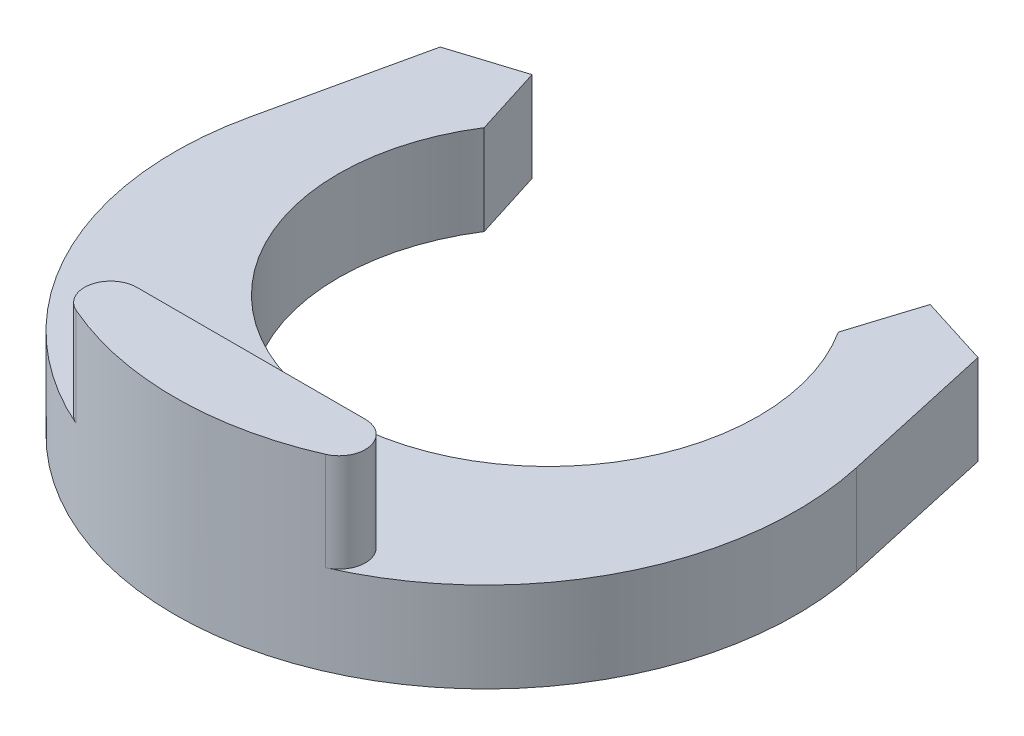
ISO-10303-21;
HEADER;
FILE_DESCRIPTION(('STEP AP214'),'2;1');
FILE_NAME('part.step','',(''),(''),'','','');
FILE_SCHEMA(('AUTOMOTIVE_DESIGN { 1 0 10303 214 1 1 1 1 }'));
ENDSEC;
DATA;
#1=APPLICATION_CONTEXT('core data for automotive mechanical design processes');
#2=APPLICATION_PROTOCOL_DEFINITION('international standard','automotive_design',2000,#1);
#3=PRODUCT_CONTEXT('',#1,'mechanical');
#4=PRODUCT('Part','Part','',(#3));
#5=PRODUCT_RELATED_PRODUCT_CATEGORY('part','',(#4));
#6=PRODUCT_DEFINITION_FORMATION('','',#4);
#7=PRODUCT_DEFINITION_CONTEXT('part definition',#1,'design');
#8=PRODUCT_DEFINITION('design','',#6,#7);
#9=PRODUCT_DEFINITION_SHAPE('','',#8);
#10=(LENGTH_UNIT() NAMED_UNIT(*) SI_UNIT(.MILLI.,.METRE.));
#11=(NAMED_UNIT(*) PLANE_ANGLE_UNIT() SI_UNIT($,.RADIAN.));
#12=(NAMED_UNIT(*) SI_UNIT($,.STERADIAN.) SOLID_ANGLE_UNIT());
#13=UNCERTAINTY_MEASURE_WITH_UNIT(LENGTH_MEASURE(1.E-05),#10,'distance_accuracy_value','');
#14=(GEOMETRIC_REPRESENTATION_CONTEXT(3) GLOBAL_UNCERTAINTY_ASSIGNED_CONTEXT((#13)) GLOBAL_UNIT_ASSIGNED_CONTEXT((#10,
#11,#12)) REPRESENTATION_CONTEXT('',''));
#15=CARTESIAN_POINT('',(0.,0.,0.));
#16=DIRECTION('',(0.,0.,1.));
#17=DIRECTION('',(1.,0.,0.));
#18=AXIS2_PLACEMENT_3D('',#15,#16,#17);
#19=CARTESIAN_POINT('',(2.094305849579,0.825,4.3));
#20=DIRECTION('',(0.,0.,-1.));
#21=DIRECTION('',(-1.,0.,0.));
#22=AXIS2_PLACEMENT_3D('',#19,#20,#21);
#23=PLANE('',#22);
#24=DIRECTION('',(0.,1.,0.));
#25=VECTOR('',#24,1.);
#26=CARTESIAN_POINT('',(2.094305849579,0.825,4.3000000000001));
#27=LINE('',#26,#25);
#28=CARTESIAN_POINT('',(2.094305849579,0.825,4.30000000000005));
#29=VERTEX_POINT('',#28);
#30=CARTESIAN_POINT('',(2.094305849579,2.625,4.30000000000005));
#31=VERTEX_POINT('',#30);
#32=EDGE_CURVE('E106',#29,#31,#27,.T.);
#33=ORIENTED_EDGE('',*,*,#32,.F.);
#34=DIRECTION('',(1.,0.,0.));
#35=VECTOR('',#34,1.);
#36=CARTESIAN_POINT('',(0.,0.825,4.3));
#37=LINE('',#36,#35);
#38=CARTESIAN_POINT('',(-2.094305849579,0.825,4.30000000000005));
#39=VERTEX_POINT('',#38);
#40=EDGE_CURVE('E126',#39,#29,#37,.T.);
#41=ORIENTED_EDGE('',*,*,#40,.F.);
#42=DIRECTION('',(0.,1.,0.));
#43=VECTOR('',#42,1.);
#44=CARTESIAN_POINT('',(-2.094305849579,0.825,4.3000000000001));
#45=LINE('',#44,#43);
#46=CARTESIAN_POINT('',(-2.094305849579,2.625,4.30000000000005));
#47=VERTEX_POINT('',#46);
#48=EDGE_CURVE('E128',#47,#39,#45,.F.);
#49=ORIENTED_EDGE('',*,*,#48,.F.);
#50=DIRECTION('',(1.,0.,0.));
#51=VECTOR('',#50,1.);
#52=CARTESIAN_POINT('',(0.,2.625,4.3));
#53=LINE('',#52,#51);
#54=EDGE_CURVE('E109',#31,#47,#53,.F.);
#55=ORIENTED_EDGE('',*,*,#54,.F.);
#56=EDGE_LOOP('',(#33,#41,#49,#55));
#57=FACE_BOUND('',#56,.T.);
#58=ADVANCED_FACE('F17',(#57),#23,.T.);
#59=CARTESIAN_POINT('',(2.094305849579,0.825,4.780694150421));
#60=DIRECTION('',(0.,1.,0.));
#61=DIRECTION('',(0.,0.,1.));
#62=AXIS2_PLACEMENT_3D('',#59,#60,#61);
#63=CYLINDRICAL_SURFACE('',#62,0.4806941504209);
#64=DIRECTION('',(0.,1.,0.));
#65=VECTOR('',#64,1.);
#66=CARTESIAN_POINT('',(2.2871898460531,-0.825,5.22099249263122));
#67=LINE('',#66,#65);
#68=CARTESIAN_POINT('',(2.28718984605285,0.825,5.22099249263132));
#69=VERTEX_POINT('',#68);
#70=CARTESIAN_POINT('',(2.28718984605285,2.625,5.22099249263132));
#71=VERTEX_POINT('',#70);
#72=EDGE_CURVE('E91',#69,#71,#67,.T.);
#73=ORIENTED_EDGE('',*,*,#72,.F.);
#74=CARTESIAN_POINT('',(2.094305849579,0.825,4.780694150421));
#75=DIRECTION('',(0.,1.,0.));
#76=DIRECTION('',(0.,0.,1.));
#77=AXIS2_PLACEMENT_3D('',#74,#75,#76);
#78=CIRCLE('',#77,0.4806941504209);
#79=EDGE_CURVE('E127',#29,#69,#78,.F.);
#80=ORIENTED_EDGE('',*,*,#79,.F.);
#81=ORIENTED_EDGE('',*,*,#32,.T.);
#82=CARTESIAN_POINT('',(2.094305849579,2.625,4.780694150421));
#83=DIRECTION('',(0.,1.,0.));
#84=DIRECTION('',(0.,0.,1.));
#85=AXIS2_PLACEMENT_3D('',#82,#83,#84);
#86=CIRCLE('',#85,0.4806941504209);
#87=EDGE_CURVE('E20',#71,#31,#86,.T.);
#88=ORIENTED_EDGE('',*,*,#87,.F.);
#89=EDGE_LOOP('',(#73,#80,#81,#88));
#90=FACE_BOUND('',#89,.T.);
#91=ADVANCED_FACE('F105',(#90),#63,.T.);
#92=CARTESIAN_POINT('',(0.,2.625,0.));
#93=DIRECTION('',(0.,1.,0.));
#94=DIRECTION('',(0.,0.,1.));
#95=AXIS2_PLACEMENT_3D('',#92,#93,#94);
#96=PLANE('',#95);
#97=ORIENTED_EDGE('',*,*,#87,.T.);
#98=ORIENTED_EDGE('',*,*,#54,.T.);
#99=CARTESIAN_POINT('',(-2.094305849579,2.625,4.780694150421));
#100=DIRECTION('',(0.,1.,0.));
#101=DIRECTION('',(0.,0.,1.));
#102=AXIS2_PLACEMENT_3D('',#99,#100,#101);
#103=CIRCLE('',#102,0.4806941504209);
#104=CARTESIAN_POINT('',(-2.28718984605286,2.625,5.22099249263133));
#105=VERTEX_POINT('',#104);
#106=EDGE_CURVE('E112',#105,#47,#103,.F.);
#107=ORIENTED_EDGE('',*,*,#106,.F.);
#108=CARTESIAN_POINT('',(0.,2.625,0.));
#109=DIRECTION('',(0.,1.,0.));
#110=DIRECTION('',(0.,0.,1.));
#111=AXIS2_PLACEMENT_3D('',#108,#109,#110);
#112=CIRCLE('',#111,5.7);
#113=EDGE_CURVE('E95',#71,#105,#112,.F.);
#114=ORIENTED_EDGE('',*,*,#113,.F.);
#115=EDGE_LOOP('',(#97,#98,#107,#114));
#116=FACE_BOUND('',#115,.T.);
#117=ADVANCED_FACE('F110',(#116),#96,.T.);
#118=CARTESIAN_POINT('',(-2.094305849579,0.825,4.780694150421));
#119=DIRECTION('',(0.,1.,0.));
#120=DIRECTION('',(0.,0.,1.));
#121=AXIS2_PLACEMENT_3D('',#118,#119,#120);
#122=CYLINDRICAL_SURFACE('',#121,0.4806941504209);
#123=ORIENTED_EDGE('',*,*,#48,.T.);
#124=CARTESIAN_POINT('',(-2.094305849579,0.825,4.780694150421));
#125=DIRECTION('',(0.,1.,0.));
#126=DIRECTION('',(0.,0.,1.));
#127=AXIS2_PLACEMENT_3D('',#124,#125,#126);
#128=CIRCLE('',#127,0.4806941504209);
#129=CARTESIAN_POINT('',(-2.28718984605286,0.825,5.22099249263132));
#130=VERTEX_POINT('',#129);
#131=EDGE_CURVE('E123',#130,#39,#128,.F.);
#132=ORIENTED_EDGE('',*,*,#131,.F.);
#133=DIRECTION('',(0.,1.,0.));
#134=VECTOR('',#133,1.);
#135=CARTESIAN_POINT('',(-2.2871898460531,-0.825,5.22099249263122));
#136=LINE('',#135,#134);
#137=EDGE_CURVE('E114',#105,#130,#136,.F.);
#138=ORIENTED_EDGE('',*,*,#137,.F.);
#139=ORIENTED_EDGE('',*,*,#106,.T.);
#140=EDGE_LOOP('',(#123,#132,#138,#139));
#141=FACE_BOUND('',#140,.T.);
#142=ADVANCED_FACE('F280',(#141),#122,.T.);
#143=CARTESIAN_POINT('',(0.,0.825,0.));
#144=DIRECTION('',(0.,1.,0.));
#145=DIRECTION('',(0.,0.,1.));
#146=AXIS2_PLACEMENT_3D('',#143,#144,#145);
#147=PLANE('',#146);
#148=ORIENTED_EDGE('',*,*,#131,.T.);
#149=ORIENTED_EDGE('',*,*,#40,.T.);
#150=ORIENTED_EDGE('',*,*,#79,.T.);
#151=CARTESIAN_POINT('',(0.,0.825,0.));
#152=DIRECTION('',(0.,1.,0.));
#153=DIRECTION('',(0.,0.,1.));
#154=AXIS2_PLACEMENT_3D('',#151,#152,#153);
#155=CIRCLE('',#154,5.7);
#156=CARTESIAN_POINT('',(5.56488724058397,0.825000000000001,-1.23370579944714));
#157=VERTEX_POINT('',#156);
#158=EDGE_CURVE('E99',#157,#69,#155,.F.);
#159=ORIENTED_EDGE('',*,*,#158,.F.);
#160=DIRECTION('',(-0.216439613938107,0.,-0.976296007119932));
#161=VECTOR('',#160,1.);
#162=CARTESIAN_POINT('',(5.564887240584,0.825000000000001,-1.233705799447));
#163=LINE('',#162,#161);
#164=CARTESIAN_POINT('',(4.93025751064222,0.825,-4.09633551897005));
#165=VERTEX_POINT('',#164);
#166=EDGE_CURVE('E185',#165,#157,#163,.F.);
#167=ORIENTED_EDGE('',*,*,#166,.F.);
#168=DIRECTION('',(-0.953716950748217,0.,-0.300705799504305));
#169=VECTOR('',#168,1.);
#170=CARTESIAN_POINT('',(4.930257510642,0.825,-4.09633551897));
#171=LINE('',#170,#169);
#172=CARTESIAN_POINT('',(3.64999734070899,0.825,-4.49999999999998));
#173=VERTEX_POINT('',#172);
#174=EDGE_CURVE('E180',#173,#165,#171,.F.);
#175=ORIENTED_EDGE('',*,*,#174,.F.);
#176=DIRECTION('',(-0.300705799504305,0.,0.953716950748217));
#177=VECTOR('',#176,1.);
#178=CARTESIAN_POINT('',(3.649997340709,0.825,-4.5));
#179=LINE('',#178,#177);
#180=CARTESIAN_POINT('',(3.24633285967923,0.825,-3.21973983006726));
#181=VERTEX_POINT('',#180);
#182=EDGE_CURVE('E166',#181,#173,#179,.F.);
#183=ORIENTED_EDGE('',*,*,#182,.F.);
#184=CARTESIAN_POINT('',(0.,0.825,-1.15));
#185=DIRECTION('',(0.,1.,0.));
#186=DIRECTION('',(0.,0.,1.));
#187=AXIS2_PLACEMENT_3D('',#184,#185,#186);
#188=CIRCLE('',#187,3.85);
#189=CARTESIAN_POINT('',(-3.24633285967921,0.825,-3.2197398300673));
#190=VERTEX_POINT('',#189);
#191=EDGE_CURVE('E153',#181,#190,#188,.F.);
#192=ORIENTED_EDGE('',*,*,#191,.T.);
#193=DIRECTION('',(-0.300705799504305,0.,-0.953716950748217));
#194=VECTOR('',#193,1.);
#195=CARTESIAN_POINT('',(-3.246332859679,0.825,-3.219739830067));
#196=LINE('',#195,#194);
#197=CARTESIAN_POINT('',(-3.64999734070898,0.825,-4.50000000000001));
#198=VERTEX_POINT('',#197);
#199=EDGE_CURVE('E145',#198,#190,#196,.F.);
#200=ORIENTED_EDGE('',*,*,#199,.F.);
#201=DIRECTION('',(-0.953716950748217,0.,0.300705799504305));
#202=VECTOR('',#201,1.);
#203=CARTESIAN_POINT('',(-3.649997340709,0.825,-4.5));
#204=LINE('',#203,#202);
#205=CARTESIAN_POINT('',(-4.93025751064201,0.825000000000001,-4.09633551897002));
#206=VERTEX_POINT('',#205);
#207=EDGE_CURVE('E142',#206,#198,#204,.F.);
#208=ORIENTED_EDGE('',*,*,#207,.F.);
#209=DIRECTION('',(-0.216439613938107,0.,0.976296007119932));
#210=VECTOR('',#209,1.);
#211=CARTESIAN_POINT('',(-4.930257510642,0.825000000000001,-4.09633551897));
#212=LINE('',#211,#210);
#213=CARTESIAN_POINT('',(-5.56488724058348,0.825,-1.23370579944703));
#214=VERTEX_POINT('',#213);
#215=EDGE_CURVE('E135',#214,#206,#212,.F.);
#216=ORIENTED_EDGE('',*,*,#215,.F.);
#217=CARTESIAN_POINT('',(0.,0.825,0.));
#218=DIRECTION('',(0.,1.,0.));
#219=DIRECTION('',(0.,0.,1.));
#220=AXIS2_PLACEMENT_3D('',#217,#218,#219);
#221=CIRCLE('',#220,5.7);
#222=EDGE_CURVE('E116',#130,#214,#221,.F.);
#223=ORIENTED_EDGE('',*,*,#222,.F.);
#224=EDGE_LOOP('',(#148,#149,#150,#159,#167,#175,#183,#192,#200,#208,#216,#223));
#225=FACE_BOUND('',#224,.T.);
#226=ADVANCED_FACE('F250',(#225),#147,.T.);
#227=CARTESIAN_POINT('',(-3.246332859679,-0.825,-3.219739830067));
#228=DIRECTION('',(0.953716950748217,0.,-0.300705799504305));
#229=DIRECTION('',(-0.300705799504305,0.,-0.953716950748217));
#230=AXIS2_PLACEMENT_3D('',#227,#228,#229);
#231=PLANE('',#230);
#232=DIRECTION('',(0.,1.,0.));
#233=VECTOR('',#232,1.);
#234=CARTESIAN_POINT('',(-3.24633285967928,-0.825,-3.21973983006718));
#235=LINE('',#234,#233);
#236=CARTESIAN_POINT('',(-3.24633285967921,-0.825,-3.2197398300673));
#237=VERTEX_POINT('',#236);
#238=EDGE_CURVE('E155',#190,#237,#235,.F.);
#239=ORIENTED_EDGE('',*,*,#238,.T.);
#240=DIRECTION('',(-0.300705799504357,0.,-0.953716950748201));
#241=VECTOR('',#240,1.);
#242=CARTESIAN_POINT('',(-3.246332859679,-0.825,-3.219739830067));
#243=LINE('',#242,#241);
#244=CARTESIAN_POINT('',(-3.649997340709,-0.825,-4.5));
#245=VERTEX_POINT('',#244);
#246=EDGE_CURVE('E159',#237,#245,#243,.T.);
#247=ORIENTED_EDGE('',*,*,#246,.T.);
#248=DIRECTION('',(0.,1.,0.));
#249=VECTOR('',#248,1.);
#250=CARTESIAN_POINT('',(-3.649997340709,-0.825,-4.5));
#251=LINE('',#250,#249);
#252=EDGE_CURVE('E139',#198,#245,#251,.F.);
#253=ORIENTED_EDGE('',*,*,#252,.F.);
#254=ORIENTED_EDGE('',*,*,#199,.T.);
#255=EDGE_LOOP('',(#239,#247,#253,#254));
#256=FACE_BOUND('',#255,.T.);
#257=ADVANCED_FACE('F240',(#256),#231,.T.);
#258=CARTESIAN_POINT('',(-3.649997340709,-0.825,-4.5));
#259=DIRECTION('',(-0.300705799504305,0.,-0.953716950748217));
#260=DIRECTION('',(-0.953716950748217,0.,0.300705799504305));
#261=AXIS2_PLACEMENT_3D('',#258,#259,#260);
#262=PLANE('',#261);
#263=ORIENTED_EDGE('',*,*,#252,.T.);
#264=DIRECTION('',(-0.953716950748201,0.,0.300705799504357));
#265=VECTOR('',#264,1.);
#266=CARTESIAN_POINT('',(-3.649997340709,-0.825,-4.5));
#267=LINE('',#266,#265);
#268=CARTESIAN_POINT('',(-4.930257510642,-0.825,-4.09633551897));
#269=VERTEX_POINT('',#268);
#270=EDGE_CURVE('E191',#245,#269,#267,.T.);
#271=ORIENTED_EDGE('',*,*,#270,.T.);
#272=DIRECTION('',(0.,1.,0.));
#273=VECTOR('',#272,1.);
#274=CARTESIAN_POINT('',(-4.930257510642,-0.825,-4.09633551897));
#275=LINE('',#274,#273);
#276=EDGE_CURVE('E138',#206,#269,#275,.F.);
#277=ORIENTED_EDGE('',*,*,#276,.F.);
#278=ORIENTED_EDGE('',*,*,#207,.T.);
#279=EDGE_LOOP('',(#263,#271,#277,#278));
#280=FACE_BOUND('',#279,.T.);
#281=ADVANCED_FACE('F246',(#280),#262,.T.);
#282=CARTESIAN_POINT('',(-4.930257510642,-0.825,-4.09633551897));
#283=DIRECTION('',(-0.976296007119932,0.,-0.216439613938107));
#284=DIRECTION('',(-0.216439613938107,0.,0.976296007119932));
#285=AXIS2_PLACEMENT_3D('',#282,#283,#284);
#286=PLANE('',#285);
#287=ORIENTED_EDGE('',*,*,#276,.T.);
#288=DIRECTION('',(-0.216439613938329,0.,0.976296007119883));
#289=VECTOR('',#288,1.);
#290=CARTESIAN_POINT('',(-4.930257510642,-0.825,-4.09633551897));
#291=LINE('',#290,#289);
#292=CARTESIAN_POINT('',(-5.56488724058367,-0.825,-1.23370579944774));
#293=VERTEX_POINT('',#292);
#294=EDGE_CURVE('E152',#269,#293,#291,.T.);
#295=ORIENTED_EDGE('',*,*,#294,.T.);
#296=DIRECTION('',(0.,1.,0.));
#297=VECTOR('',#296,1.);
#298=CARTESIAN_POINT('',(-5.56488724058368,-0.825,-1.23370579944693));
#299=LINE('',#298,#297);
#300=EDGE_CURVE('E122',#214,#293,#299,.F.);
#301=ORIENTED_EDGE('',*,*,#300,.F.);
#302=ORIENTED_EDGE('',*,*,#215,.T.);
#303=EDGE_LOOP('',(#287,#295,#301,#302));
#304=FACE_BOUND('',#303,.T.);
#305=ADVANCED_FACE('F223',(#304),#286,.T.);
#306=CARTESIAN_POINT('',(0.,-0.825,0.));
#307=DIRECTION('',(0.,1.,0.));
#308=DIRECTION('',(0.,0.,1.));
#309=AXIS2_PLACEMENT_3D('',#306,#307,#308);
#310=CYLINDRICAL_SURFACE('',#309,5.7);
#311=ORIENTED_EDGE('',*,*,#137,.T.);
#312=ORIENTED_EDGE('',*,*,#222,.T.);
#313=ORIENTED_EDGE('',*,*,#300,.T.);
#314=CARTESIAN_POINT('',(0.,-0.825,0.));
#315=DIRECTION('',(0.,1.,0.));
#316=DIRECTION('',(0.,0.,1.));
#317=AXIS2_PLACEMENT_3D('',#314,#315,#316);
#318=CIRCLE('',#317,5.7);
#319=CARTESIAN_POINT('',(5.56488724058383,-0.825,-1.23370579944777));
#320=VERTEX_POINT('',#319);
#321=EDGE_CURVE('E149',#293,#320,#318,.T.);
#322=ORIENTED_EDGE('',*,*,#321,.T.);
#323=DIRECTION('',(0.,1.,0.));
#324=VECTOR('',#323,1.);
#325=CARTESIAN_POINT('',(5.564887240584,-0.825,-1.233705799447));
#326=LINE('',#325,#324);
#327=EDGE_CURVE('E183',#157,#320,#326,.F.);
#328=ORIENTED_EDGE('',*,*,#327,.F.);
#329=ORIENTED_EDGE('',*,*,#158,.T.);
#330=ORIENTED_EDGE('',*,*,#72,.T.);
#331=ORIENTED_EDGE('',*,*,#113,.T.);
#332=EDGE_LOOP('',(#311,#312,#313,#322,#328,#329,#330,#331));
#333=FACE_BOUND('',#332,.T.);
#334=ADVANCED_FACE('F93',(#333),#310,.T.);
#335=CARTESIAN_POINT('',(5.564887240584,-0.825,-1.233705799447));
#336=DIRECTION('',(0.976296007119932,0.,-0.216439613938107));
#337=DIRECTION('',(-0.216439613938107,0.,-0.976296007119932));
#338=AXIS2_PLACEMENT_3D('',#335,#336,#337);
#339=PLANE('',#338);
#340=ORIENTED_EDGE('',*,*,#327,.T.);
#341=DIRECTION('',(-0.216439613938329,0.,-0.976296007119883));
#342=VECTOR('',#341,1.);
#343=CARTESIAN_POINT('',(5.564887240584,-0.825,-1.233705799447));
#344=LINE('',#343,#342);
#345=CARTESIAN_POINT('',(4.930257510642,-0.825,-4.09633551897));
#346=VERTEX_POINT('',#345);
#347=EDGE_CURVE('E151',#320,#346,#344,.T.);
#348=ORIENTED_EDGE('',*,*,#347,.T.);
#349=DIRECTION('',(0.,1.,0.));
#350=VECTOR('',#349,1.);
#351=CARTESIAN_POINT('',(4.930257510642,-0.825,-4.09633551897));
#352=LINE('',#351,#350);
#353=EDGE_CURVE('E177',#165,#346,#352,.F.);
#354=ORIENTED_EDGE('',*,*,#353,.F.);
#355=ORIENTED_EDGE('',*,*,#166,.T.);
#356=EDGE_LOOP('',(#340,#348,#354,#355));
#357=FACE_BOUND('',#356,.T.);
#358=ADVANCED_FACE('F266',(#357),#339,.T.);
#359=CARTESIAN_POINT('',(4.930257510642,-0.825,-4.09633551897));
#360=DIRECTION('',(0.300705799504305,0.,-0.953716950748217));
#361=DIRECTION('',(-0.953716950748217,0.,-0.300705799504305));
#362=AXIS2_PLACEMENT_3D('',#359,#360,#361);
#363=PLANE('',#362);
#364=ORIENTED_EDGE('',*,*,#353,.T.);
#365=DIRECTION('',(-0.953716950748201,0.,-0.300705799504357));
#366=VECTOR('',#365,1.);
#367=CARTESIAN_POINT('',(4.930257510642,-0.825,-4.09633551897));
#368=LINE('',#367,#366);
#369=CARTESIAN_POINT('',(3.649997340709,-0.825,-4.5));
#370=VERTEX_POINT('',#369);
#371=EDGE_CURVE('E172',#346,#370,#368,.T.);
#372=ORIENTED_EDGE('',*,*,#371,.T.);
#373=DIRECTION('',(0.,1.,0.));
#374=VECTOR('',#373,1.);
#375=CARTESIAN_POINT('',(3.649997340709,-0.825,-4.5));
#376=LINE('',#375,#374);
#377=EDGE_CURVE('E161',#173,#370,#376,.F.);
#378=ORIENTED_EDGE('',*,*,#377,.F.);
#379=ORIENTED_EDGE('',*,*,#174,.T.);
#380=EDGE_LOOP('',(#364,#372,#378,#379));
#381=FACE_BOUND('',#380,.T.);
#382=ADVANCED_FACE('F261',(#381),#363,.T.);
#383=CARTESIAN_POINT('',(3.649997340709,-0.825,-4.5));
#384=DIRECTION('',(-0.953716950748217,0.,-0.300705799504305));
#385=DIRECTION('',(-0.300705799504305,0.,0.953716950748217));
#386=AXIS2_PLACEMENT_3D('',#383,#384,#385);
#387=PLANE('',#386);
#388=ORIENTED_EDGE('',*,*,#377,.T.);
#389=DIRECTION('',(-0.300705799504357,0.,0.953716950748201));
#390=VECTOR('',#389,1.);
#391=CARTESIAN_POINT('',(3.649997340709,-0.825,-4.5));
#392=LINE('',#391,#390);
#393=CARTESIAN_POINT('',(3.24633285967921,-0.825,-3.2197398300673));
#394=VERTEX_POINT('',#393);
#395=EDGE_CURVE('E26',#370,#394,#392,.T.);
#396=ORIENTED_EDGE('',*,*,#395,.T.);
#397=DIRECTION('',(0.,1.,0.));
#398=VECTOR('',#397,1.);
#399=CARTESIAN_POINT('',(3.24633285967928,-0.825,-3.21973983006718));
#400=LINE('',#399,#398);
#401=EDGE_CURVE('E34',#394,#181,#400,.T.);
#402=ORIENTED_EDGE('',*,*,#401,.T.);
#403=ORIENTED_EDGE('',*,*,#182,.T.);
#404=EDGE_LOOP('',(#388,#396,#402,#403));
#405=FACE_BOUND('',#404,.T.);
#406=ADVANCED_FACE('F253',(#405),#387,.T.);
#407=CARTESIAN_POINT('',(0.,-0.825,-1.15));
#408=DIRECTION('',(0.,1.,0.));
#409=DIRECTION('',(0.,0.,1.));
#410=AXIS2_PLACEMENT_3D('',#407,#408,#409);
#411=CYLINDRICAL_SURFACE('',#410,3.85);
#412=ORIENTED_EDGE('',*,*,#191,.F.);
#413=ORIENTED_EDGE('',*,*,#401,.F.);
#414=CARTESIAN_POINT('',(0.,-0.825,-1.15));
#415=DIRECTION('',(0.,1.,0.));
#416=DIRECTION('',(0.,0.,1.));
#417=AXIS2_PLACEMENT_3D('',#414,#415,#416);
#418=CIRCLE('',#417,3.85);
#419=EDGE_CURVE('E11',#394,#237,#418,.F.);
#420=ORIENTED_EDGE('',*,*,#419,.T.);
#421=ORIENTED_EDGE('',*,*,#238,.F.);
#422=EDGE_LOOP('',(#412,#413,#420,#421));
#423=FACE_BOUND('',#422,.T.);
#424=ADVANCED_FACE('F251',(#423),#411,.F.);
#425=CARTESIAN_POINT('',(0.,-0.825,0.));
#426=DIRECTION('',(0.,1.,0.));
#427=DIRECTION('',(0.,0.,1.));
#428=AXIS2_PLACEMENT_3D('',#425,#426,#427);
#429=PLANE('',#428);
#430=ORIENTED_EDGE('',*,*,#395,.F.);
#431=ORIENTED_EDGE('',*,*,#371,.F.);
#432=ORIENTED_EDGE('',*,*,#347,.F.);
#433=ORIENTED_EDGE('',*,*,#321,.F.);
#434=ORIENTED_EDGE('',*,*,#294,.F.);
#435=ORIENTED_EDGE('',*,*,#270,.F.);
#436=ORIENTED_EDGE('',*,*,#246,.F.);
#437=ORIENTED_EDGE('',*,*,#419,.F.);
#438=EDGE_LOOP('',(#430,#431,#432,#433,#434,#435,#436,#437));
#439=FACE_BOUND('',#438,.T.);
#440=ADVANCED_FACE('F244',(#439),#429,.F.);
#441=CLOSED_SHELL('',(#58,#91,#117,#142,#226,#257,#281,#305,#334,#358,#382,#406,#424,#440));
#442=MANIFOLD_SOLID_BREP('B1',#441);
#443=ADVANCED_BREP_SHAPE_REPRESENTATION('',(#18,#442),#14);
#444=SHAPE_DEFINITION_REPRESENTATION(#9,#443);
ENDSEC;
END-ISO-10303-21;
